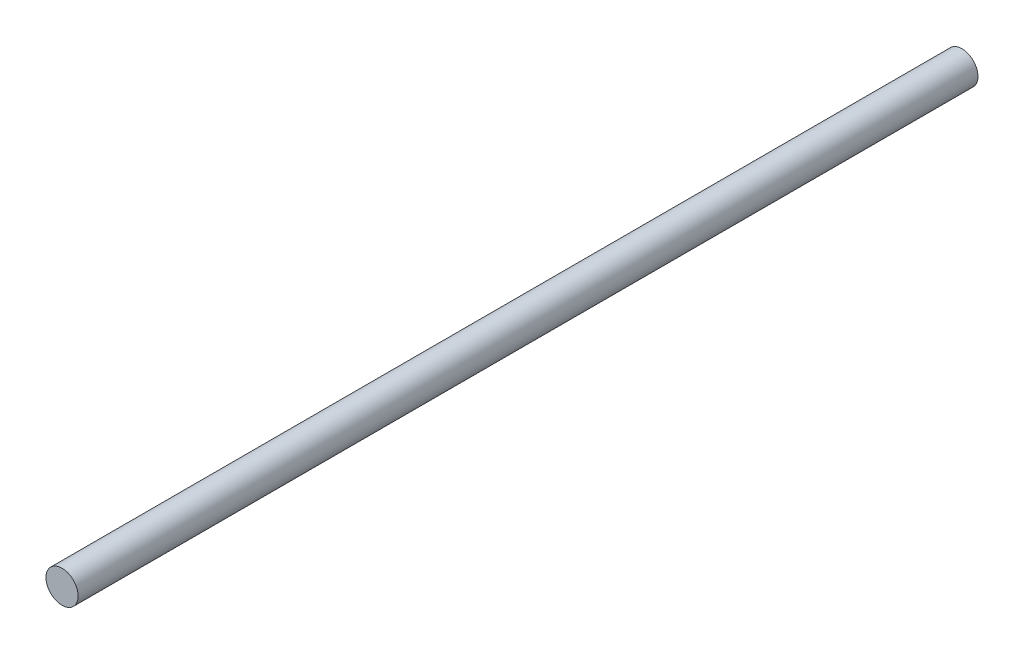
from build123d import *

# Parameters (mm, degrees)
SKETCH1_R      = 3.96875
EXTRUDE1_DEPTH = 222.25


with BuildPart() as part:
    # Sketch1 → Extrude1 (new body)
    with BuildSketch(Plane.XY):
        Circle(SKETCH1_R)
    extrude(amount=EXTRUDE1_DEPTH)


solid = part.part
